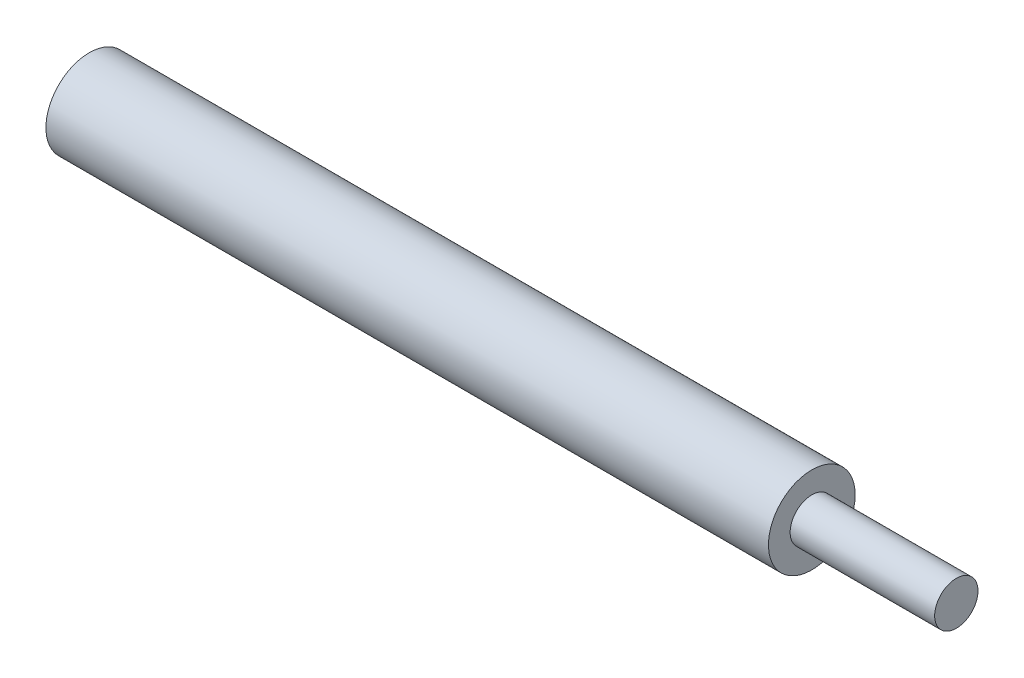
from build123d import *

# Parameters (mm, degrees)
ESQUISSE1_R      = 3
EXTRUSION1_DEPTH = 50
ESQUISSE2_R      = 1.5
EXTRUSION2_DEPTH = 10


with BuildPart() as part:
    # Esquisse1 → Extrusion1 (new body)
    with BuildSketch(Plane(origin=(0, 0, 0), x_dir=(0, 0, -1), z_dir=(1, 0, 0))):
        Circle(ESQUISSE1_R)
    extrude(amount=-EXTRUSION1_DEPTH)

    # Esquisse2 → Extrusion2 (add)
    with BuildSketch(Plane(origin=(0, 0, 0), x_dir=(0, 0, -1), z_dir=(1, 0, 0))):
        Circle(ESQUISSE2_R)
    extrude(amount=EXTRUSION2_DEPTH)


solid = part.part
